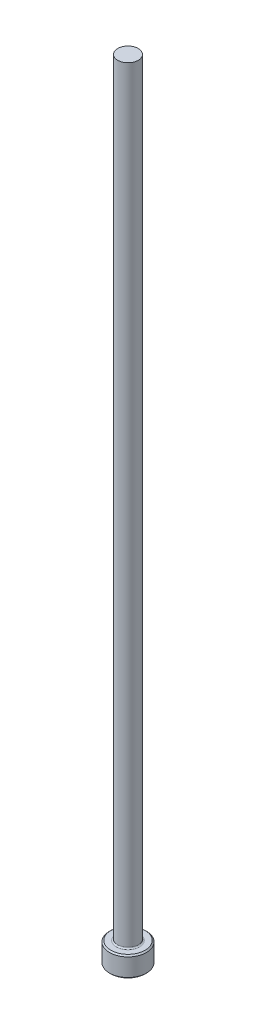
from build123d import *

# Parameters (mm, degrees)
CHAMFER1_SIZE = 0.254
FILLET1_R     = 0.254


with BuildPart() as part:
    # Sketch1 → Revolve1 (revolve)
    with BuildSketch(Plane.XY, mode=Mode.PRIVATE) as revolve1_sk:
        Polygon((0, 0), (-3.5687, 0), (-3.5687, 3.9624), (-1.98374, 3.9624), (-1.98374, 152.4), (0, 152.4), align=None)
    revolve(revolve1_sk.sketch.rotate(Axis((0, 259.958771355, 0), (0, -1, 0)), 270), axis=Axis((0, 259.958771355, 0), (0, -1, 0)))

    # Chamfer1
    chamfer1_edges = [part.edges().sort_by_distance(p)[0] for p in [
        (0, 3.9624, -3.5687),
        (0, 0, -3.5687),
    ]]
    chamfer(chamfer1_edges, length=CHAMFER1_SIZE)

    # Fillet1
    fillet1_edges = [part.edges().sort_by_distance(p)[0] for p in [
        (0, 3.9624, -1.98374),
    ]]
    fillet(fillet1_edges, radius=FILLET1_R)


solid = part.part
